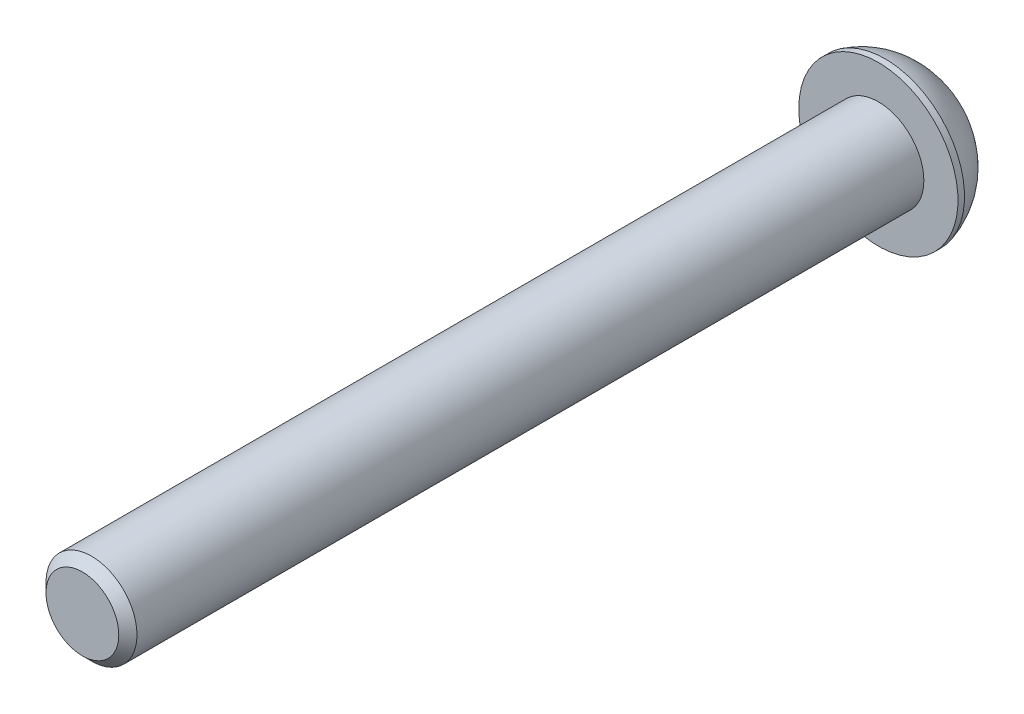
from build123d import *

# Parameters (mm, degrees)
ENLEV_MAT_EXTRU1_DEPTH = 2.6
ESQUISSE3_W            = 4
ESQUISSE3_H            = 70
CHANFREIN1_SIZE        = 0.8


with BuildPart() as part:
    # Esquisse1 → Base-R_volution (revolve)
    with BuildSketch(Plane(origin=(0, 0, 0), x_dir=(1, 0, 0), z_dir=(0, 1, 0)), mode=Mode.PRIVATE) as base_r_volution_sk:
        with BuildLine():
            Line((0, 0), (7, 0))
            Line((7, 0), (7, 0.574933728))
            ThreePointArc((7, 0.574933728), (5.912888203, 2.77937838), (4.064923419, 4.4))
            Line((4.064923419, 4.4), (0, 4.4))
            Line((0, 4.4), (0, 0))
        make_face()
    revolve(base_r_volution_sk.sketch.rotate(Axis((0, 0, 0), (0, 0, -1)), 180), axis=Axis((0, 0, 0), (0, 0, -1)))

    # Esquisse2 → enlev-mat-Extru1 (cut)
    with BuildSketch(Plane.XY.offset(-4.4)):
        Polygon((2.5, -1.443375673), (2.5, 1.443375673), (0, 2.886751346), (-2.5, 1.443375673), (-2.5, -1.443375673), (0, -2.886751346), align=None)
    extrude(amount=ENLEV_MAT_EXTRU1_DEPTH, mode=Mode.SUBTRACT)

    # Esquisse3 → Boss.-R_vol.1 (revolve)
    with BuildSketch(Plane(origin=(0, 0, 0), x_dir=(1, 0, 0), z_dir=(0, 1, 0)), mode=Mode.PRIVATE) as boss_r_vol_1_sk:
        with Locations((2, -35)):
            Rectangle(ESQUISSE3_W, ESQUISSE3_H)
    revolve(boss_r_vol_1_sk.sketch.rotate(Axis((0, 0, 0), (0, 0, 1)), 180), axis=Axis((0, 0, 0), (0, 0, 1)))

    # Chanfrein1
    chanfrein1_edges = [part.edges().sort_by_distance(p)[0] for p in [
        (4, 0, 70),
    ]]
    chamfer(chanfrein1_edges, length=CHANFREIN1_SIZE)


solid = part.part
